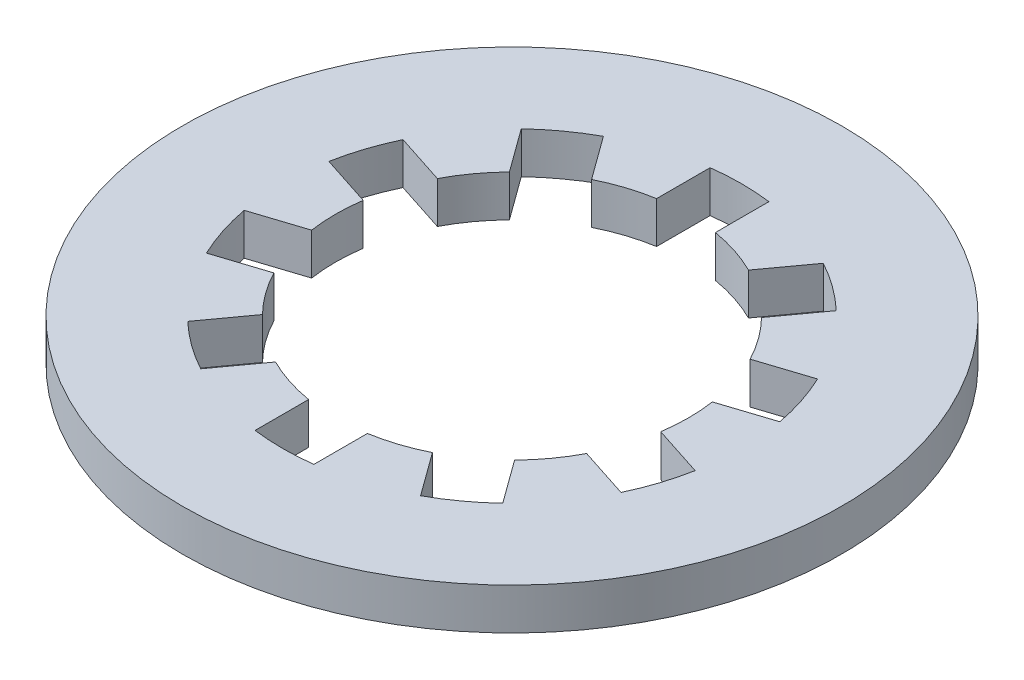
from build123d import *

# Parameters (mm, degrees)
SKETCH1_R          = 4.8387
SKETCH1_R_2        = 2.5908
EXTRUDE1_DEPTH     = 0.6096
CUT_EXTRUDE1_DEPTH = 7.870054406
CIRPATTERN1_COUNT  = 10


with BuildPart() as part:
    # Sketch1 → Extrude1 (new body)
    with BuildSketch(Plane(origin=(0, 0, 0), x_dir=(1, 0, 0), z_dir=(0, 1, 0))):
        with Locations(Location((0, 0, 0), (0, 0, 270))):
            Circle(SKETCH1_R)
        with Locations(Location((0, 0, 0), (0, 0, 270))):
            Circle(SKETCH1_R_2, mode=Mode.SUBTRACT)
    extrude(amount=EXTRUDE1_DEPTH)

    # Sketch2 → Cut-Extrude1 (cut, through all)
    with BuildSketch(Plane(origin=(0, 0.6096, 0), x_dir=(-1, 0, 0), z_dir=(0, 1, 0))):
        with BuildLine():
            Line((-0.4318, 3.34024583), (-0.4318, 2.55456325))
            ThreePointArc((-0.4318, 2.55456325), (0, 2.5908), (0.4318, 2.55456325))
            Line((0.4318, 2.55456325), (0.4318, 3.34024583))
            ThreePointArc((0.4318, 3.34024583), (0, 3.36804), (-0.4318, 3.34024583))
        make_face()
    cut_extrude1 = extrude(amount=-CUT_EXTRUDE1_DEPTH, mode=Mode.SUBTRACT)

    # CirPattern1: Cut-Extrude1 ×10 about axis
    cirpattern1_axis = Axis((0, 0, 0), (0, 1, 0))
    for i in range(1, CIRPATTERN1_COUNT):
        add(cut_extrude1.rotate(cirpattern1_axis, i * 360 / CIRPATTERN1_COUNT), mode=Mode.SUBTRACT)


solid = part.part
